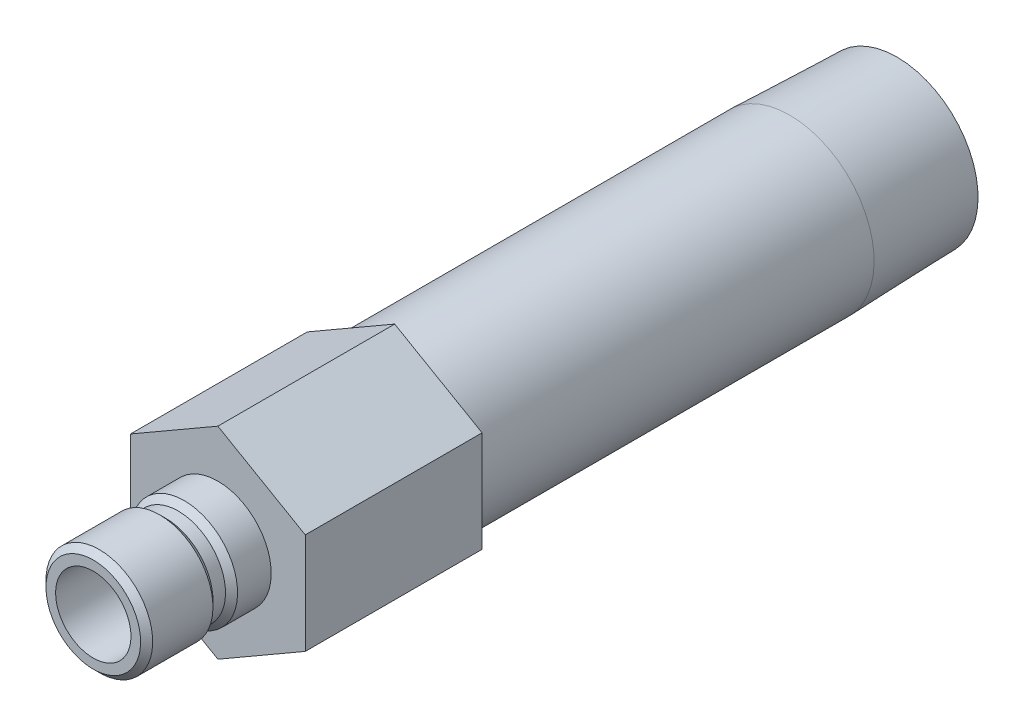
from build123d import *

# Parameters (mm, degrees)
SKETCH2_R           = 4.7625
BOSS_EXTRUDE1_DEPTH = 22.352


with BuildPart() as part:
    # Sketch1 → Revolve1 (revolve)
    with BuildSketch(Plane(origin=(0, 0, 0), x_dir=(0, 0, -1), z_dir=(1, 0, 0))):
        Polygon((-15.748, 4.7625), (-15.748, 5.9817), (-14.986, 6.7437), (-7.366, 6.7437), (-6.604, 5.9817), (-5.0165, 5.9817), (-4.2545, 6.7437), (0, 6.7437), (0, 10.668), (72.2884, 10.668), (85.852, 10.244140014), (85.852, 7.8994), (22.352, 7.8994), (22.352, 4.7625), align=None)
    revolve(axis=Axis((0, 0, 0), (0, 0, 1)))

    # Sketch2 → Boss-Extrude1 (add)
    with BuildSketch(Plane.XY):
        Polygon((-11.049, 6.379143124), (-11.049, -6.379143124), (0, -12.758286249), (11.049, -6.379143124), (11.049, 6.379143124), (0, 12.758286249), align=None)
        with Locations(Location((0, 0, 0), (0, 0, 90))):
            Circle(SKETCH2_R, mode=Mode.SUBTRACT)
    extrude(amount=-BOSS_EXTRUDE1_DEPTH)


solid = part.part
